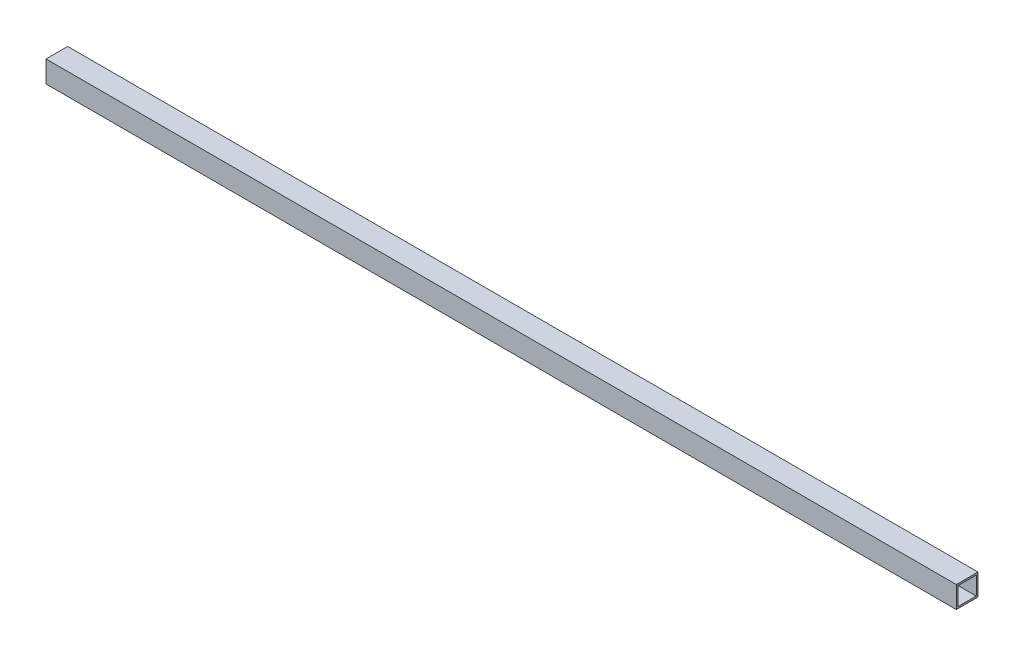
from build123d import *

# Parameters (mm, degrees)
ESQUISSE1_W             = 1050
ESQUISSE1_H             = 25
BOSS_EXTRU_1_DEPTH      = 25
ESQUISSE2_W             = 21
ESQUISSE2_H             = 21
ENL_V_MAT_EXTRU_1_DEPTH = 1051.595069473


with BuildPart() as part:
    # Esquisse1 → Boss.-Extru.1 (new body)
    with BuildSketch(Plane.XY):
        with Locations((525, 12.5)):
            Rectangle(ESQUISSE1_W, ESQUISSE1_H)
    extrude(amount=BOSS_EXTRU_1_DEPTH)

    # Esquisse2 → Enl_v. mat.-Extru.1 (cut, through all)
    with BuildSketch(Plane.ZY):
        with Locations((12.5, 12.5)):
            Rectangle(ESQUISSE2_W, ESQUISSE2_H)
    extrude(amount=-ENL_V_MAT_EXTRU_1_DEPTH, mode=Mode.SUBTRACT)


solid = part.part
